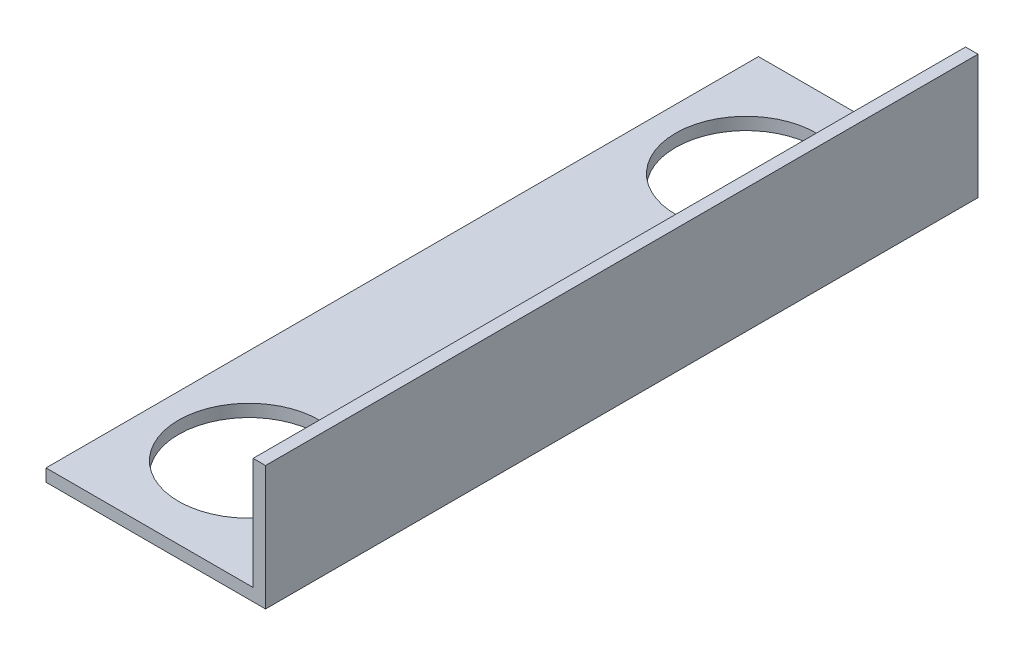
ISO-10303-21;
HEADER;
FILE_DESCRIPTION(('STEP AP214'),'2;1');
FILE_NAME('part.step','',(''),(''),'','','');
FILE_SCHEMA(('AUTOMOTIVE_DESIGN { 1 0 10303 214 1 1 1 1 }'));
ENDSEC;
DATA;
#1=APPLICATION_CONTEXT('core data for automotive mechanical design processes');
#2=APPLICATION_PROTOCOL_DEFINITION('international standard','automotive_design',2000,#1);
#3=PRODUCT_CONTEXT('',#1,'mechanical');
#4=PRODUCT('Part','Part','',(#3));
#5=PRODUCT_RELATED_PRODUCT_CATEGORY('part','',(#4));
#6=PRODUCT_DEFINITION_FORMATION('','',#4);
#7=PRODUCT_DEFINITION_CONTEXT('part definition',#1,'design');
#8=PRODUCT_DEFINITION('design','',#6,#7);
#9=PRODUCT_DEFINITION_SHAPE('','',#8);
#10=(LENGTH_UNIT() NAMED_UNIT(*) SI_UNIT(.MILLI.,.METRE.));
#11=(NAMED_UNIT(*) PLANE_ANGLE_UNIT() SI_UNIT($,.RADIAN.));
#12=(NAMED_UNIT(*) SI_UNIT($,.STERADIAN.) SOLID_ANGLE_UNIT());
#13=UNCERTAINTY_MEASURE_WITH_UNIT(LENGTH_MEASURE(1.E-05),#10,'distance_accuracy_value','');
#14=(GEOMETRIC_REPRESENTATION_CONTEXT(3) GLOBAL_UNCERTAINTY_ASSIGNED_CONTEXT((#13)) GLOBAL_UNIT_ASSIGNED_CONTEXT((#10,
#11,#12)) REPRESENTATION_CONTEXT('',''));
#15=CARTESIAN_POINT('',(0.,0.,0.));
#16=DIRECTION('',(0.,0.,1.));
#17=DIRECTION('',(1.,0.,0.));
#18=AXIS2_PLACEMENT_3D('',#15,#16,#17);
#19=CARTESIAN_POINT('',(-1.5,-13.5,0.));
#20=DIRECTION('',(-1.,0.,0.));
#21=DIRECTION('',(0.,0.,1.));
#22=AXIS2_PLACEMENT_3D('',#19,#20,#21);
#23=PLANE('',#22);
#24=DIRECTION('',(0.,1.,0.));
#25=VECTOR('',#24,1.);
#26=CARTESIAN_POINT('',(-1.5,-11.566265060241,-43.));
#27=LINE('',#26,#25);
#28=CARTESIAN_POINT('',(-1.5,0.,-43.));
#29=VERTEX_POINT('',#28);
#30=CARTESIAN_POINT('',(-1.5,-13.5,-43.));
#31=VERTEX_POINT('',#30);
#32=EDGE_CURVE('E118',#29,#31,#27,.F.);
#33=ORIENTED_EDGE('',*,*,#32,.T.);
#34=DIRECTION('',(0.,0.,1.));
#35=VECTOR('',#34,1.);
#36=CARTESIAN_POINT('',(-1.5,-13.5,0.));
#37=LINE('',#36,#35);
#38=CARTESIAN_POINT('',(-1.5,-13.5,43.));
#39=VERTEX_POINT('',#38);
#40=EDGE_CURVE('E66',#39,#31,#37,.F.);
#41=ORIENTED_EDGE('',*,*,#40,.F.);
#42=DIRECTION('',(0.,1.,0.));
#43=VECTOR('',#42,1.);
#44=CARTESIAN_POINT('',(-1.5,-11.566265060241,43.));
#45=LINE('',#44,#43);
#46=CARTESIAN_POINT('',(-1.5,0.,43.));
#47=VERTEX_POINT('',#46);
#48=EDGE_CURVE('E81',#47,#39,#45,.F.);
#49=ORIENTED_EDGE('',*,*,#48,.F.);
#50=DIRECTION('',(0.,0.,1.));
#51=VECTOR('',#50,1.);
#52=CARTESIAN_POINT('',(-1.5,0.,0.));
#53=LINE('',#52,#51);
#54=EDGE_CURVE('E71',#29,#47,#53,.T.);
#55=ORIENTED_EDGE('',*,*,#54,.F.);
#56=EDGE_LOOP('',(#33,#41,#49,#55));
#57=FACE_BOUND('',#56,.T.);
#58=ADVANCED_FACE('F16',(#57),#23,.T.);
#59=CARTESIAN_POINT('',(-1.5,0.,0.));
#60=DIRECTION('',(0.,1.,0.));
#61=DIRECTION('',(0.,0.,1.));
#62=AXIS2_PLACEMENT_3D('',#59,#60,#61);
#63=PLANE('',#62);
#64=DIRECTION('',(1.,0.,0.));
#65=VECTOR('',#64,1.);
#66=CARTESIAN_POINT('',(-9.18373493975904,0.,-43.));
#67=LINE('',#66,#65);
#68=CARTESIAN_POINT('',(0.,0.,-43.));
#69=VERTEX_POINT('',#68);
#70=EDGE_CURVE('E77',#69,#29,#67,.F.);
#71=ORIENTED_EDGE('',*,*,#70,.T.);
#72=ORIENTED_EDGE('',*,*,#54,.T.);
#73=DIRECTION('',(1.,0.,0.));
#74=VECTOR('',#73,1.);
#75=CARTESIAN_POINT('',(-9.18373493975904,0.,43.));
#76=LINE('',#75,#74);
#77=CARTESIAN_POINT('',(0.,0.,43.));
#78=VERTEX_POINT('',#77);
#79=EDGE_CURVE('E75',#78,#47,#76,.F.);
#80=ORIENTED_EDGE('',*,*,#79,.F.);
#81=DIRECTION('',(0.,0.,-1.));
#82=VECTOR('',#81,1.);
#83=CARTESIAN_POINT('',(0.,0.,0.));
#84=LINE('',#83,#82);
#85=EDGE_CURVE('E104',#69,#78,#84,.F.);
#86=ORIENTED_EDGE('',*,*,#85,.F.);
#87=EDGE_LOOP('',(#71,#72,#80,#86));
#88=FACE_BOUND('',#87,.T.);
#89=ADVANCED_FACE('F72',(#88),#63,.T.);
#90=CARTESIAN_POINT('',(-26.5,-13.5,0.));
#91=DIRECTION('',(0.,1.,0.));
#92=DIRECTION('',(0.,0.,1.));
#93=AXIS2_PLACEMENT_3D('',#90,#91,#92);
#94=PLANE('',#93);
#95=CARTESIAN_POINT('',(-15.,-13.5,30.));
#96=DIRECTION('',(0.,1.,0.));
#97=DIRECTION('',(-1.,0.,0.));
#98=AXIS2_PLACEMENT_3D('',#95,#96,#97);
#99=CIRCLE('',#98,8.5);
#100=CARTESIAN_POINT('',(-23.5,-13.5,30.));
#101=VERTEX_POINT('',#100);
#102=EDGE_CURVE('E95',#101,#101,#99,.F.);
#103=ORIENTED_EDGE('',*,*,#102,.T.);
#104=EDGE_LOOP('',(#103));
#105=FACE_BOUND('',#104,.T.);
#106=CARTESIAN_POINT('',(-15.,-13.5,-30.));
#107=DIRECTION('',(0.,1.,0.));
#108=DIRECTION('',(-1.,0.,0.));
#109=AXIS2_PLACEMENT_3D('',#106,#107,#108);
#110=CIRCLE('',#109,8.5);
#111=CARTESIAN_POINT('',(-23.5,-13.5,-30.));
#112=VERTEX_POINT('',#111);
#113=EDGE_CURVE('E19',#112,#112,#110,.F.);
#114=ORIENTED_EDGE('',*,*,#113,.T.);
#115=EDGE_LOOP('',(#114));
#116=FACE_BOUND('',#115,.T.);
#117=DIRECTION('',(1.,0.,0.));
#118=VECTOR('',#117,1.);
#119=CARTESIAN_POINT('',(-9.18373493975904,-13.5,-43.));
#120=LINE('',#119,#118);
#121=CARTESIAN_POINT('',(-26.5,-13.5,-43.));
#122=VERTEX_POINT('',#121);
#123=EDGE_CURVE('E116',#31,#122,#120,.F.);
#124=ORIENTED_EDGE('',*,*,#123,.T.);
#125=DIRECTION('',(0.,0.,1.));
#126=VECTOR('',#125,1.);
#127=CARTESIAN_POINT('',(-26.5,-13.5,0.));
#128=LINE('',#127,#126);
#129=CARTESIAN_POINT('',(-26.5,-13.5,43.));
#130=VERTEX_POINT('',#129);
#131=EDGE_CURVE('E120',#130,#122,#128,.F.);
#132=ORIENTED_EDGE('',*,*,#131,.F.);
#133=DIRECTION('',(1.,0.,0.));
#134=VECTOR('',#133,1.);
#135=CARTESIAN_POINT('',(-9.18373493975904,-13.5,43.));
#136=LINE('',#135,#134);
#137=EDGE_CURVE('E83',#39,#130,#136,.F.);
#138=ORIENTED_EDGE('',*,*,#137,.F.);
#139=ORIENTED_EDGE('',*,*,#40,.T.);
#140=EDGE_LOOP('',(#124,#132,#138,#139));
#141=FACE_BOUND('',#140,.T.);
#142=ADVANCED_FACE('F128',(#105,#116,#141),#94,.T.);
#143=CARTESIAN_POINT('',(-9.18373493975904,-11.566265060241,43.));
#144=DIRECTION('',(0.,0.,1.));
#145=DIRECTION('',(1.,0.,0.));
#146=AXIS2_PLACEMENT_3D('',#143,#144,#145);
#147=PLANE('',#146);
#148=ORIENTED_EDGE('',*,*,#137,.T.);
#149=DIRECTION('',(0.,1.,0.));
#150=VECTOR('',#149,1.);
#151=CARTESIAN_POINT('',(-26.5,-15.,43.));
#152=LINE('',#151,#150);
#153=CARTESIAN_POINT('',(-26.5,-15.,43.));
#154=VERTEX_POINT('',#153);
#155=EDGE_CURVE('E123',#154,#130,#152,.T.);
#156=ORIENTED_EDGE('',*,*,#155,.F.);
#157=DIRECTION('',(1.,0.,0.));
#158=VECTOR('',#157,1.);
#159=CARTESIAN_POINT('',(0.,-15.,43.));
#160=LINE('',#159,#158);
#161=CARTESIAN_POINT('',(0.,-15.,43.));
#162=VERTEX_POINT('',#161);
#163=EDGE_CURVE('E97',#162,#154,#160,.F.);
#164=ORIENTED_EDGE('',*,*,#163,.F.);
#165=DIRECTION('',(0.,1.,0.));
#166=VECTOR('',#165,1.);
#167=CARTESIAN_POINT('',(0.,0.,43.));
#168=LINE('',#167,#166);
#169=EDGE_CURVE('E87',#78,#162,#168,.F.);
#170=ORIENTED_EDGE('',*,*,#169,.F.);
#171=ORIENTED_EDGE('',*,*,#79,.T.);
#172=ORIENTED_EDGE('',*,*,#48,.T.);
#173=EDGE_LOOP('',(#148,#156,#164,#170,#171,#172));
#174=FACE_BOUND('',#173,.T.);
#175=ADVANCED_FACE('F85',(#174),#147,.T.);
#176=CARTESIAN_POINT('',(-26.5,-15.,0.));
#177=DIRECTION('',(-1.,0.,0.));
#178=DIRECTION('',(0.,0.,1.));
#179=AXIS2_PLACEMENT_3D('',#176,#177,#178);
#180=PLANE('',#179);
#181=DIRECTION('',(0.,1.,0.));
#182=VECTOR('',#181,1.);
#183=CARTESIAN_POINT('',(-26.5,-11.566265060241,-43.));
#184=LINE('',#183,#182);
#185=CARTESIAN_POINT('',(-26.5,-15.,-43.));
#186=VERTEX_POINT('',#185);
#187=EDGE_CURVE('E114',#122,#186,#184,.F.);
#188=ORIENTED_EDGE('',*,*,#187,.T.);
#189=DIRECTION('',(0.,0.,-1.));
#190=VECTOR('',#189,1.);
#191=CARTESIAN_POINT('',(-26.5,-15.,0.));
#192=LINE('',#191,#190);
#193=EDGE_CURVE('E101',#154,#186,#192,.T.);
#194=ORIENTED_EDGE('',*,*,#193,.F.);
#195=ORIENTED_EDGE('',*,*,#155,.T.);
#196=ORIENTED_EDGE('',*,*,#131,.T.);
#197=EDGE_LOOP('',(#188,#194,#195,#196));
#198=FACE_BOUND('',#197,.T.);
#199=ADVANCED_FACE('F132',(#198),#180,.T.);
#200=CARTESIAN_POINT('',(-9.18373493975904,-11.566265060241,-43.));
#201=DIRECTION('',(0.,0.,1.));
#202=DIRECTION('',(1.,0.,0.));
#203=AXIS2_PLACEMENT_3D('',#200,#201,#202);
#204=PLANE('',#203);
#205=DIRECTION('',(0.,1.,0.));
#206=VECTOR('',#205,1.);
#207=CARTESIAN_POINT('',(0.,0.,-43.));
#208=LINE('',#207,#206);
#209=CARTESIAN_POINT('',(0.,-15.,-43.));
#210=VERTEX_POINT('',#209);
#211=EDGE_CURVE('E34',#210,#69,#208,.T.);
#212=ORIENTED_EDGE('',*,*,#211,.F.);
#213=DIRECTION('',(1.,0.,0.));
#214=VECTOR('',#213,1.);
#215=CARTESIAN_POINT('',(0.,-15.,-43.));
#216=LINE('',#215,#214);
#217=EDGE_CURVE('E136',#186,#210,#216,.T.);
#218=ORIENTED_EDGE('',*,*,#217,.F.);
#219=ORIENTED_EDGE('',*,*,#187,.F.);
#220=ORIENTED_EDGE('',*,*,#123,.F.);
#221=ORIENTED_EDGE('',*,*,#32,.F.);
#222=ORIENTED_EDGE('',*,*,#70,.F.);
#223=EDGE_LOOP('',(#212,#218,#219,#220,#221,#222));
#224=FACE_BOUND('',#223,.T.);
#225=ADVANCED_FACE('F142',(#224),#204,.F.);
#226=CARTESIAN_POINT('',(0.,0.,0.));
#227=DIRECTION('',(1.,0.,0.));
#228=DIRECTION('',(0.,0.,-1.));
#229=AXIS2_PLACEMENT_3D('',#226,#227,#228);
#230=PLANE('',#229);
#231=ORIENTED_EDGE('',*,*,#211,.T.);
#232=ORIENTED_EDGE('',*,*,#85,.T.);
#233=ORIENTED_EDGE('',*,*,#169,.T.);
#234=DIRECTION('',(0.,0.,-1.));
#235=VECTOR('',#234,1.);
#236=CARTESIAN_POINT('',(0.,-15.,0.));
#237=LINE('',#236,#235);
#238=EDGE_CURVE('E94',#210,#162,#237,.F.);
#239=ORIENTED_EDGE('',*,*,#238,.F.);
#240=EDGE_LOOP('',(#231,#232,#233,#239));
#241=FACE_BOUND('',#240,.T.);
#242=ADVANCED_FACE('F139',(#241),#230,.T.);
#243=CARTESIAN_POINT('',(-15.,-15.,-30.));
#244=DIRECTION('',(0.,1.,0.));
#245=DIRECTION('',(-1.,0.,0.));
#246=AXIS2_PLACEMENT_3D('',#243,#244,#245);
#247=CYLINDRICAL_SURFACE('',#246,8.5);
#248=CARTESIAN_POINT('',(-15.,-15.,-30.));
#249=DIRECTION('',(0.,1.,0.));
#250=DIRECTION('',(-1.,0.,0.));
#251=AXIS2_PLACEMENT_3D('',#248,#249,#250);
#252=CIRCLE('',#251,8.5);
#253=CARTESIAN_POINT('',(-23.5,-15.,-30.));
#254=VERTEX_POINT('',#253);
#255=EDGE_CURVE('E25',#254,#254,#252,.T.);
#256=ORIENTED_EDGE('',*,*,#255,.F.);
#257=EDGE_LOOP('',(#256));
#258=FACE_BOUND('',#257,.T.);
#259=ORIENTED_EDGE('',*,*,#113,.F.);
#260=EDGE_LOOP('',(#259));
#261=FACE_BOUND('',#260,.T.);
#262=ADVANCED_FACE('F150',(#258,#261),#247,.F.);
#263=CARTESIAN_POINT('',(-15.,-15.,30.));
#264=DIRECTION('',(0.,1.,0.));
#265=DIRECTION('',(-1.,0.,0.));
#266=AXIS2_PLACEMENT_3D('',#263,#264,#265);
#267=CYLINDRICAL_SURFACE('',#266,8.5);
#268=CARTESIAN_POINT('',(-15.,-15.,30.));
#269=DIRECTION('',(0.,1.,0.));
#270=DIRECTION('',(-1.,0.,0.));
#271=AXIS2_PLACEMENT_3D('',#268,#269,#270);
#272=CIRCLE('',#271,8.5);
#273=CARTESIAN_POINT('',(-23.5,-15.,30.));
#274=VERTEX_POINT('',#273);
#275=EDGE_CURVE('E11',#274,#274,#272,.T.);
#276=ORIENTED_EDGE('',*,*,#275,.F.);
#277=EDGE_LOOP('',(#276));
#278=FACE_BOUND('',#277,.T.);
#279=ORIENTED_EDGE('',*,*,#102,.F.);
#280=EDGE_LOOP('',(#279));
#281=FACE_BOUND('',#280,.T.);
#282=ADVANCED_FACE('F154',(#278,#281),#267,.F.);
#283=CARTESIAN_POINT('',(0.,-15.,0.));
#284=DIRECTION('',(0.,-1.,0.));
#285=DIRECTION('',(0.,0.,-1.));
#286=AXIS2_PLACEMENT_3D('',#283,#284,#285);
#287=PLANE('',#286);
#288=ORIENTED_EDGE('',*,*,#275,.T.);
#289=EDGE_LOOP('',(#288));
#290=FACE_BOUND('',#289,.T.);
#291=ORIENTED_EDGE('',*,*,#255,.T.);
#292=EDGE_LOOP('',(#291));
#293=FACE_BOUND('',#292,.T.);
#294=ORIENTED_EDGE('',*,*,#217,.T.);
#295=ORIENTED_EDGE('',*,*,#238,.T.);
#296=ORIENTED_EDGE('',*,*,#163,.T.);
#297=ORIENTED_EDGE('',*,*,#193,.T.);
#298=EDGE_LOOP('',(#294,#295,#296,#297));
#299=FACE_BOUND('',#298,.T.);
#300=ADVANCED_FACE('F138',(#290,#293,#299),#287,.T.);
#301=CLOSED_SHELL('',(#58,#89,#142,#175,#199,#225,#242,#262,#282,#300));
#302=MANIFOLD_SOLID_BREP('B1',#301);
#303=ADVANCED_BREP_SHAPE_REPRESENTATION('',(#18,#302),#14);
#304=SHAPE_DEFINITION_REPRESENTATION(#9,#303);
ENDSEC;
END-ISO-10303-21;
